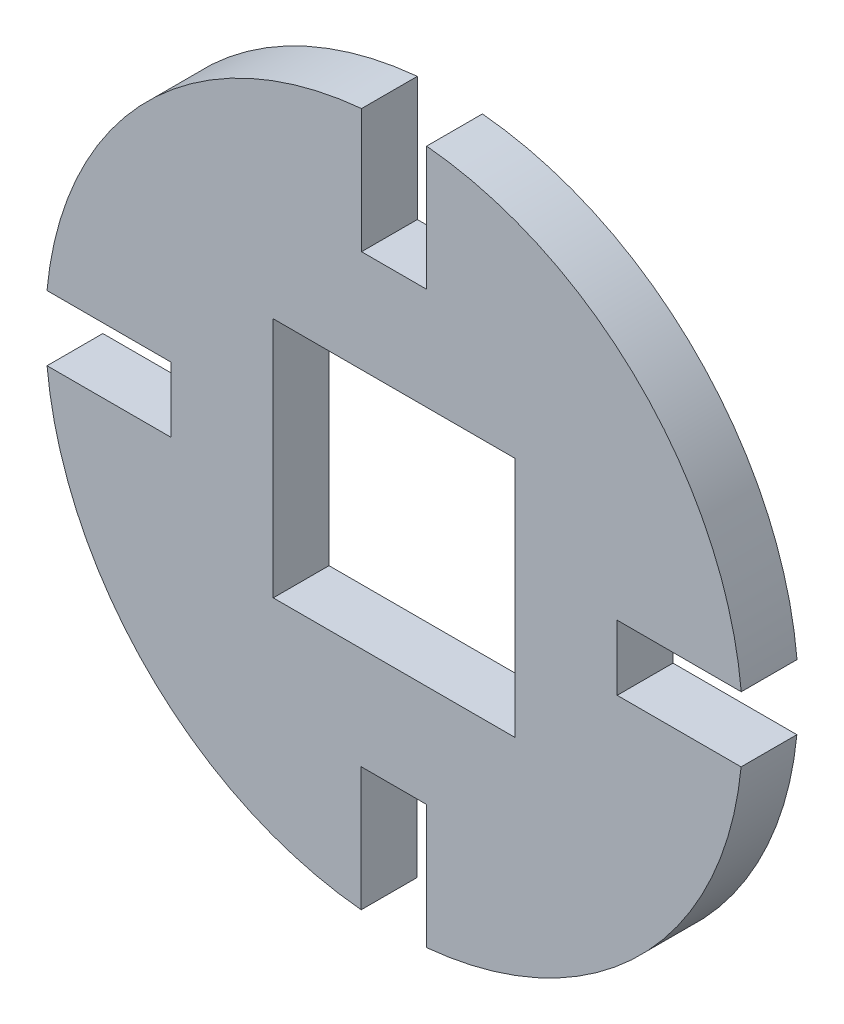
from build123d import *

# Parameters (mm, degrees)
SKETCH1_W           = 13
SKETCH1_H           = 13
BOSS_EXTRUDE1_DEPTH = 3


with BuildPart() as part:
    # Sketch1 → Boss-Extrude1 (new body)
    with BuildSketch(Plane.XY):
        with BuildLine():
            Line((12, -1.789872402), (12, 1.710127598))
            Line((12, 1.710127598), (18.671849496, 1.710127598))
            ThreePointArc((18.671849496, 1.710127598), (13.272402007, 13.24408717), (1.75, 18.668154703))
            Line((1.75, 18.668154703), (1.75, 11.998154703))
            Line((1.75, 11.998154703), (-1.75, 11.998154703))
            Line((-1.75, 11.998154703), (-1.75, 18.668154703))
            ThreePointArc((-1.75, 18.668154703), (-13.265280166, 13.251220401), (-18.67, 1.7302023))
            Line((-18.67, 1.7302023), (-12, 1.7302023))
            Line((-12, 1.7302023), (-12, -1.7697977))
            Line((-12, -1.7697977), (-18.666288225, -1.7697977))
            ThreePointArc((-18.666288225, -1.7697977), (-13.258252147, -13.258252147), (-1.7697977, -18.666288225))
            Line((-1.7697977, -18.666288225), (-1.7697977, -12))
            Line((-1.7697977, -12), (1.7302023, -12))
            Line((1.7302023, -12), (1.7302023, -18.67))
            ThreePointArc((1.7302023, -18.67), (13.237045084, -13.279425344), (18.664373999, -1.789872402))
            Line((18.664373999, -1.789872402), (12, -1.789872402))
        make_face()
        Rectangle(SKETCH1_W, SKETCH1_H, mode=Mode.SUBTRACT)
    extrude(amount=BOSS_EXTRUDE1_DEPTH)


solid = part.part
